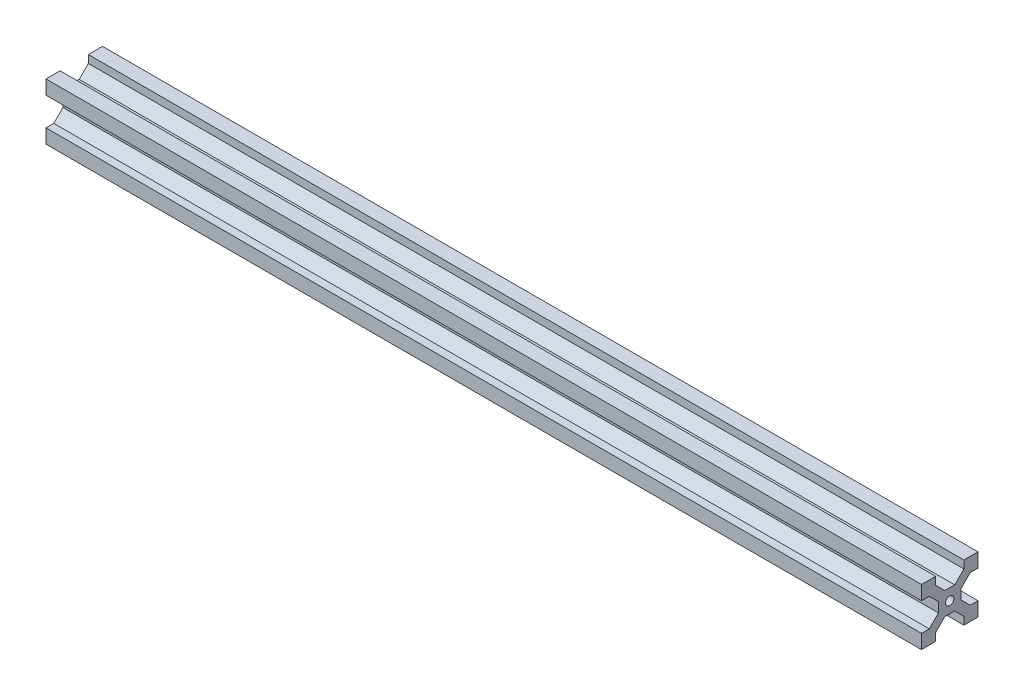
from build123d import *

# Parameters (mm, degrees)
CROQUIS1_R              = 1.5
SALIENTE_EXTRUIR1_DEPTH = 155


with BuildPart() as part:
    # Croquis1 → Saliente-Extruir1 (new, symmetric)
    with BuildSketch(Plane(origin=(0, 0, 0), x_dir=(0, 0, -1), z_dir=(1, 0, 0))):
        Polygon((-5, 10), (-5, 7.25), (-1.75, 4), (0, 4), (1.75, 4), (5, 7.25), (5, 10), (10, 10), (10, 5), (7.25, 5), (4, 1.75), (4, -1.75), (7.25, -5), (10, -5), (10, -10), (5, -10), (5, -7.25), (1.75, -4), (-1.75, -4), (-5, -7.25), (-5, -10), (-10, -10), (-10, -5), (-7.25, -5), (-4, -1.75), (-4, 1.75), (-7.25, 5), (-10, 5), (-10, 10), align=None)
        Circle(CROQUIS1_R, mode=Mode.SUBTRACT)
    extrude(amount=SALIENTE_EXTRUIR1_DEPTH, both=True)


solid = part.part
